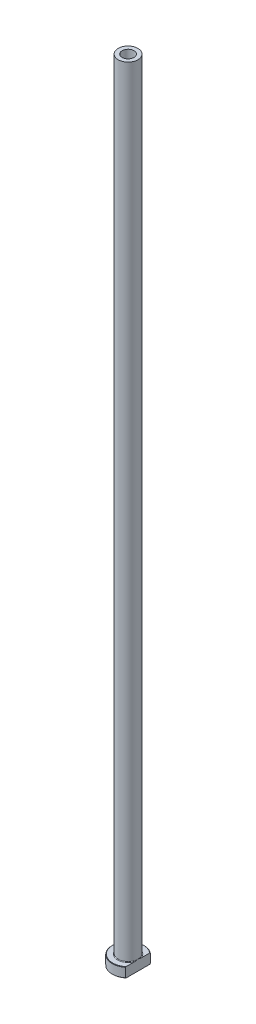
ISO-10303-21;
HEADER;
FILE_DESCRIPTION(('STEP AP214'),'2;1');
FILE_NAME('part.step','',(''),(''),'','','');
FILE_SCHEMA(('AUTOMOTIVE_DESIGN { 1 0 10303 214 1 1 1 1 }'));
ENDSEC;
DATA;
#1=APPLICATION_CONTEXT('core data for automotive mechanical design processes');
#2=APPLICATION_PROTOCOL_DEFINITION('international standard','automotive_design',2000,#1);
#3=PRODUCT_CONTEXT('',#1,'mechanical');
#4=PRODUCT('Part','Part','',(#3));
#5=PRODUCT_RELATED_PRODUCT_CATEGORY('part','',(#4));
#6=PRODUCT_DEFINITION_FORMATION('','',#4);
#7=PRODUCT_DEFINITION_CONTEXT('part definition',#1,'design');
#8=PRODUCT_DEFINITION('design','',#6,#7);
#9=PRODUCT_DEFINITION_SHAPE('','',#8);
#10=(LENGTH_UNIT() NAMED_UNIT(*) SI_UNIT(.MILLI.,.METRE.));
#11=(NAMED_UNIT(*) PLANE_ANGLE_UNIT() SI_UNIT($,.RADIAN.));
#12=(NAMED_UNIT(*) SI_UNIT($,.STERADIAN.) SOLID_ANGLE_UNIT());
#13=UNCERTAINTY_MEASURE_WITH_UNIT(LENGTH_MEASURE(1.E-05),#10,'distance_accuracy_value','');
#14=(GEOMETRIC_REPRESENTATION_CONTEXT(3) GLOBAL_UNCERTAINTY_ASSIGNED_CONTEXT((#13)) GLOBAL_UNIT_ASSIGNED_CONTEXT((#10,
#11,#12)) REPRESENTATION_CONTEXT('',''));
#15=CARTESIAN_POINT('',(0.,0.,0.));
#16=DIRECTION('',(0.,0.,1.));
#17=DIRECTION('',(1.,0.,0.));
#18=AXIS2_PLACEMENT_3D('',#15,#16,#17);
#19=CARTESIAN_POINT('',(0.,92.1876809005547,0.));
#20=DIRECTION('',(0.,1.,0.));
#21=DIRECTION('',(0.,0.,1.));
#22=AXIS2_PLACEMENT_3D('',#19,#20,#21);
#23=CYLINDRICAL_SURFACE('',#22,3.00000000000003);
#24=CARTESIAN_POINT('',(0.,400.,0.));
#25=DIRECTION('',(0.,1.,0.));
#26=DIRECTION('',(0.,0.,1.));
#27=AXIS2_PLACEMENT_3D('',#24,#25,#26);
#28=CIRCLE('',#27,3.00000000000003);
#29=CARTESIAN_POINT('',(0.,400.,3.00000000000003));
#30=VERTEX_POINT('',#29);
#31=EDGE_CURVE('E167',#30,#30,#28,.T.);
#32=ORIENTED_EDGE('',*,*,#31,.T.);
#33=EDGE_LOOP('',(#32));
#34=FACE_BOUND('',#33,.T.);
#35=CARTESIAN_POINT('',(0.,355.,0.));
#36=DIRECTION('',(0.,1.,0.));
#37=DIRECTION('',(0.,0.,1.));
#38=AXIS2_PLACEMENT_3D('',#35,#36,#37);
#39=CIRCLE('',#38,3.00000000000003);
#40=CARTESIAN_POINT('',(0.,355.,3.00000000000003));
#41=VERTEX_POINT('',#40);
#42=EDGE_CURVE('E170',#41,#41,#39,.T.);
#43=ORIENTED_EDGE('',*,*,#42,.F.);
#44=EDGE_LOOP('',(#43));
#45=FACE_BOUND('',#44,.T.);
#46=ADVANCED_FACE('F32',(#34,#45),#23,.F.);
#47=CARTESIAN_POINT('',(-3.00000000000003,400.,0.));
#48=DIRECTION('',(0.,1.,0.));
#49=DIRECTION('',(0.,0.,1.));
#50=AXIS2_PLACEMENT_3D('',#47,#48,#49);
#51=PLANE('',#50);
#52=CARTESIAN_POINT('',(0.,400.,0.));
#53=DIRECTION('',(0.,1.,0.));
#54=DIRECTION('',(0.,0.,1.));
#55=AXIS2_PLACEMENT_3D('',#52,#53,#54);
#56=CIRCLE('',#55,5.00000000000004);
#57=CARTESIAN_POINT('',(0.,400.,5.00000000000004));
#58=VERTEX_POINT('',#57);
#59=EDGE_CURVE('E174',#58,#58,#56,.T.);
#60=ORIENTED_EDGE('',*,*,#59,.T.);
#61=EDGE_LOOP('',(#60));
#62=FACE_BOUND('',#61,.T.);
#63=ORIENTED_EDGE('',*,*,#31,.F.);
#64=EDGE_LOOP('',(#63));
#65=FACE_BOUND('',#64,.T.);
#66=ADVANCED_FACE('F157',(#62,#65),#51,.T.);
#67=CARTESIAN_POINT('',(0.,92.1876809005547,0.));
#68=DIRECTION('',(0.,1.,0.));
#69=DIRECTION('',(0.,0.,1.));
#70=AXIS2_PLACEMENT_3D('',#67,#68,#69);
#71=CYLINDRICAL_SURFACE('',#70,5.00000000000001);
#72=CARTESIAN_POINT('',(0.,5.3,0.));
#73=DIRECTION('',(0.,1.,0.));
#74=DIRECTION('',(0.,0.,1.));
#75=AXIS2_PLACEMENT_3D('',#72,#73,#74);
#76=CIRCLE('',#75,5.00000000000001);
#77=CARTESIAN_POINT('',(5.,5.3,0.));
#78=VERTEX_POINT('',#77);
#79=EDGE_CURVE('E180',#78,#78,#76,.T.);
#80=ORIENTED_EDGE('',*,*,#79,.T.);
#81=EDGE_LOOP('',(#80));
#82=FACE_BOUND('',#81,.T.);
#83=ORIENTED_EDGE('',*,*,#59,.F.);
#84=EDGE_LOOP('',(#83));
#85=FACE_BOUND('',#84,.T.);
#86=ADVANCED_FACE('F162',(#82,#85),#71,.T.);
#87=CARTESIAN_POINT('',(-4.99999999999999,5.,0.));
#88=DIRECTION('',(0.,1.,0.));
#89=DIRECTION('',(0.,0.,1.));
#90=AXIS2_PLACEMENT_3D('',#87,#88,#89);
#91=PLANE('',#90);
#92=DIRECTION('',(0.,0.,1.));
#93=VECTOR('',#92,1.);
#94=CARTESIAN_POINT('',(5.,5.,0.));
#95=LINE('',#94,#93);
#96=CARTESIAN_POINT('',(5.,5.,-5.98665181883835));
#97=VERTEX_POINT('',#96);
#98=CARTESIAN_POINT('',(5.,5.,-1.75783958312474));
#99=VERTEX_POINT('',#98);
#100=EDGE_CURVE('E54',#97,#99,#95,.T.);
#101=ORIENTED_EDGE('',*,*,#100,.F.);
#102=CARTESIAN_POINT('',(0.,5.,0.));
#103=DIRECTION('',(0.,1.,0.));
#104=DIRECTION('',(0.,0.,1.));
#105=AXIS2_PLACEMENT_3D('',#102,#103,#104);
#106=CIRCLE('',#105,7.80000000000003);
#107=CARTESIAN_POINT('',(4.99999999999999,5.,5.98665181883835));
#108=VERTEX_POINT('',#107);
#109=EDGE_CURVE('E186',#97,#108,#106,.T.);
#110=ORIENTED_EDGE('',*,*,#109,.T.);
#111=CARTESIAN_POINT('',(5.,5.,1.75783958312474));
#112=VERTEX_POINT('',#111);
#113=EDGE_CURVE('E134',#112,#108,#95,.T.);
#114=ORIENTED_EDGE('',*,*,#113,.F.);
#115=CARTESIAN_POINT('',(0.,5.,0.));
#116=DIRECTION('',(0.,1.,0.));
#117=DIRECTION('',(0.,0.,1.));
#118=AXIS2_PLACEMENT_3D('',#115,#116,#117);
#119=CIRCLE('',#118,5.30000000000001);
#120=EDGE_CURVE('E183',#112,#99,#119,.F.);
#121=ORIENTED_EDGE('',*,*,#120,.T.);
#122=EDGE_LOOP('',(#101,#110,#114,#121));
#123=FACE_BOUND('',#122,.T.);
#124=ADVANCED_FACE('F197',(#123),#91,.T.);
#125=CARTESIAN_POINT('',(0.,92.1876809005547,0.));
#126=DIRECTION('',(0.,1.,0.));
#127=DIRECTION('',(0.,0.,1.));
#128=AXIS2_PLACEMENT_3D('',#125,#126,#127);
#129=CYLINDRICAL_SURFACE('',#128,7.99999999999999);
#130=DIRECTION('',(0.,-1.,0.));
#131=VECTOR('',#130,1.);
#132=CARTESIAN_POINT('',(4.99999999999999,400.,6.24499799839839));
#133=LINE('',#132,#131);
#134=CARTESIAN_POINT('',(4.99999999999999,4.80000000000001,6.24499799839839));
#135=VERTEX_POINT('',#134);
#136=CARTESIAN_POINT('',(4.99999999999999,0.200000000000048,6.24499799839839));
#137=VERTEX_POINT('',#136);
#138=EDGE_CURVE('E82',#135,#137,#133,.T.);
#139=ORIENTED_EDGE('',*,*,#138,.F.);
#140=CARTESIAN_POINT('',(0.,4.80000000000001,0.));
#141=DIRECTION('',(0.,1.,0.));
#142=DIRECTION('',(0.,0.,1.));
#143=AXIS2_PLACEMENT_3D('',#140,#141,#142);
#144=CIRCLE('',#143,7.99999999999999);
#145=CARTESIAN_POINT('',(5.,4.80000000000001,-6.24499799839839));
#146=VERTEX_POINT('',#145);
#147=EDGE_CURVE('E95',#135,#146,#144,.F.);
#148=ORIENTED_EDGE('',*,*,#147,.T.);
#149=DIRECTION('',(0.,-1.,0.));
#150=VECTOR('',#149,1.);
#151=CARTESIAN_POINT('',(5.,400.,-6.24499799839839));
#152=LINE('',#151,#150);
#153=CARTESIAN_POINT('',(5.,0.200000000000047,-6.24499799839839));
#154=VERTEX_POINT('',#153);
#155=EDGE_CURVE('E192',#146,#154,#152,.T.);
#156=ORIENTED_EDGE('',*,*,#155,.T.);
#157=CARTESIAN_POINT('',(0.,0.200000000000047,0.));
#158=DIRECTION('',(0.,-1.,0.));
#159=DIRECTION('',(0.,0.,-1.));
#160=AXIS2_PLACEMENT_3D('',#157,#158,#159);
#161=CIRCLE('',#160,7.99999999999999);
#162=EDGE_CURVE('E98',#154,#137,#161,.F.);
#163=ORIENTED_EDGE('',*,*,#162,.T.);
#164=EDGE_LOOP('',(#139,#148,#156,#163));
#165=FACE_BOUND('',#164,.T.);
#166=ADVANCED_FACE('F190',(#165),#129,.T.);
#167=CARTESIAN_POINT('',(-7.99999999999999,0.,0.));
#168=DIRECTION('',(0.,-1.,0.));
#169=DIRECTION('',(0.,0.,-1.));
#170=AXIS2_PLACEMENT_3D('',#167,#168,#169);
#171=PLANE('',#170);
#172=CARTESIAN_POINT('',(0.,0.,0.));
#173=DIRECTION('',(0.,-1.,0.));
#174=DIRECTION('',(0.,0.,-1.));
#175=AXIS2_PLACEMENT_3D('',#172,#173,#174);
#176=CIRCLE('',#175,3.75000000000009);
#177=CARTESIAN_POINT('',(0.,0.,-3.75000000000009));
#178=VERTEX_POINT('',#177);
#179=EDGE_CURVE('E40',#178,#178,#176,.F.);
#180=ORIENTED_EDGE('',*,*,#179,.T.);
#181=EDGE_LOOP('',(#180));
#182=FACE_BOUND('',#181,.T.);
#183=DIRECTION('',(0.,0.,-1.));
#184=VECTOR('',#183,1.);
#185=CARTESIAN_POINT('',(4.99999999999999,0.,6.24499799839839));
#186=LINE('',#185,#184);
#187=CARTESIAN_POINT('',(4.99999999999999,0.,5.9866518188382));
#188=VERTEX_POINT('',#187);
#189=CARTESIAN_POINT('',(5.,0.,-5.9866518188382));
#190=VERTEX_POINT('',#189);
#191=EDGE_CURVE('E47',#188,#190,#186,.T.);
#192=ORIENTED_EDGE('',*,*,#191,.F.);
#193=CARTESIAN_POINT('',(0.,0.,0.));
#194=DIRECTION('',(0.,-1.,0.));
#195=DIRECTION('',(0.,0.,-1.));
#196=AXIS2_PLACEMENT_3D('',#193,#194,#195);
#197=CIRCLE('',#196,7.79999999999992);
#198=EDGE_CURVE('E92',#188,#190,#197,.T.);
#199=ORIENTED_EDGE('',*,*,#198,.T.);
#200=EDGE_LOOP('',(#192,#199));
#201=FACE_BOUND('',#200,.T.);
#202=ADVANCED_FACE('F91',(#182,#201),#171,.T.);
#203=CARTESIAN_POINT('',(0.,92.1876809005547,0.));
#204=DIRECTION('',(0.,1.,0.));
#205=DIRECTION('',(0.,0.,1.));
#206=AXIS2_PLACEMENT_3D('',#203,#204,#205);
#207=CYLINDRICAL_SURFACE('',#206,3.25000000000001);
#208=CARTESIAN_POINT('',(0.,0.500000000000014,0.));
#209=DIRECTION('',(0.,-1.,0.));
#210=DIRECTION('',(0.,0.,-1.));
#211=AXIS2_PLACEMENT_3D('',#208,#209,#210);
#212=CIRCLE('',#211,3.25000000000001);
#213=CARTESIAN_POINT('',(0.,0.500000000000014,-3.25000000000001));
#214=VERTEX_POINT('',#213);
#215=EDGE_CURVE('E11',#214,#214,#212,.T.);
#216=ORIENTED_EDGE('',*,*,#215,.T.);
#217=EDGE_LOOP('',(#216));
#218=FACE_BOUND('',#217,.T.);
#219=CARTESIAN_POINT('',(0.,343.,0.));
#220=DIRECTION('',(0.,1.,0.));
#221=DIRECTION('',(0.,0.,1.));
#222=AXIS2_PLACEMENT_3D('',#219,#220,#221);
#223=CIRCLE('',#222,3.25000000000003);
#224=CARTESIAN_POINT('',(0.,343.,3.25000000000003));
#225=VERTEX_POINT('',#224);
#226=EDGE_CURVE('E172',#225,#225,#223,.T.);
#227=ORIENTED_EDGE('',*,*,#226,.T.);
#228=EDGE_LOOP('',(#227));
#229=FACE_BOUND('',#228,.T.);
#230=ADVANCED_FACE('F215',(#218,#229),#207,.F.);
#231=CARTESIAN_POINT('',(0.,343.,0.));
#232=DIRECTION('',(0.,-1.,0.));
#233=DIRECTION('',(0.,0.,-1.));
#234=AXIS2_PLACEMENT_3D('',#231,#232,#233);
#235=CONICAL_SURFACE('',#234,3.25000000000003,0.0208303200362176);
#236=ORIENTED_EDGE('',*,*,#42,.T.);
#237=EDGE_LOOP('',(#236));
#238=FACE_BOUND('',#237,.T.);
#239=ORIENTED_EDGE('',*,*,#226,.F.);
#240=EDGE_LOOP('',(#239));
#241=FACE_BOUND('',#240,.T.);
#242=ADVANCED_FACE('F111',(#238,#241),#235,.F.);
#243=CARTESIAN_POINT('',(0.,5.3,0.));
#244=DIRECTION('',(0.,1.,0.));
#245=DIRECTION('',(0.,0.,1.));
#246=AXIS2_PLACEMENT_3D('',#243,#244,#245);
#247=TOROIDAL_SURFACE('',#246,5.30000000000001,0.3);
#248=ORIENTED_EDGE('',*,*,#120,.F.);
#249=CARTESIAN_POINT('',(5.,5.3,0.));
#250=CARTESIAN_POINT('',(5.,5.30000062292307,-1.31469219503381E-10));
#251=CARTESIAN_POINT('',(5.,5.30000124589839,2.52759529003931E-07));
#252=CARTESIAN_POINT('',(5.,5.30000240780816,9.47164985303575E-07));
#253=CARTESIAN_POINT('',(5.,5.30000293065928,1.40594109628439E-06));
#254=CARTESIAN_POINT('',(5.,5.30000402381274,2.50637707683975E-06));
#255=CARTESIAN_POINT('',(5.,5.30000457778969,3.16589032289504E-06));
#256=CARTESIAN_POINT('',(5.,5.30000556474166,4.5286010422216E-06));
#257=CARTESIAN_POINT('',(5.,5.3000060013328,5.22939577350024E-06));
#258=CARTESIAN_POINT('',(5.,5.30000763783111,7.96122203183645E-06));
#259=CARTESIAN_POINT('',(5.,5.30000875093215,1.00477437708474E-05));
#260=CARTESIAN_POINT('',(5.,5.30001056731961,1.41660905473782E-05));
#261=CARTESIAN_POINT('',(5.,5.30001129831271,1.61861811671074E-05));
#262=CARTESIAN_POINT('',(5.,5.30001439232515,2.47865788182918E-05));
#263=CARTESIAN_POINT('',(5.,5.30001672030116,3.1383034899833E-05));
#264=CARTESIAN_POINT('',(5.,5.30002012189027,4.38084295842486E-05));
#265=CARTESIAN_POINT('',(5.,5.30002133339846,4.95992806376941E-05));
#266=CARTESIAN_POINT('',(5.,5.30003020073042,9.2786271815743E-05));
#267=CARTESIAN_POINT('',(5.,5.30003696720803,0.000130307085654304));
#268=CARTESIAN_POINT('',(4.99999999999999,5.30006659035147,0.000278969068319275));
#269=CARTESIAN_POINT('',(5.,5.30009481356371,0.000389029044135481));
#270=CARTESIAN_POINT('',(5.,5.30020506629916,0.000826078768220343));
#271=CARTESIAN_POINT('',(5.,5.30028365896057,0.00115365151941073));
#272=CARTESIAN_POINT('',(4.99999999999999,5.30059919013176,0.00245925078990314));
#273=CARTESIAN_POINT('',(4.99999999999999,5.30084048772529,0.00343651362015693));
#274=CARTESIAN_POINT('',(5.,5.30184626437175,0.00752058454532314));
#275=CARTESIAN_POINT('',(5.,5.30260525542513,0.0106283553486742));
#276=CARTESIAN_POINT('',(4.99999999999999,5.30996461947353,0.0407482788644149));
#277=CARTESIAN_POINT('',(4.99999999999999,5.31658985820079,0.0677561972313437));
#278=CARTESIAN_POINT('',(5.,5.32953319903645,0.120688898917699));
#279=CARTESIAN_POINT('',(5.,5.33585289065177,0.146613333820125));
#280=CARTESIAN_POINT('',(4.99999999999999,5.34926050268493,0.201795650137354));
#281=CARTESIAN_POINT('',(5.,5.35634306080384,0.231054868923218));
#282=CARTESIAN_POINT('',(5.,5.37050252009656,0.289917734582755));
#283=CARTESIAN_POINT('',(5.,5.37757848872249,0.319521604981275));
#284=CARTESIAN_POINT('',(5.,5.39452602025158,0.391032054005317));
#285=CARTESIAN_POINT('',(5.,5.40434071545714,0.432952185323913));
#286=CARTESIAN_POINT('',(5.,5.42340141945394,0.515763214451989));
#287=CARTESIAN_POINT('',(5.,5.43265559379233,0.556652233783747));
#288=CARTESIAN_POINT('',(5.,5.45710553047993,0.667075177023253));
#289=CARTESIAN_POINT('',(5.,5.47194176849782,0.736689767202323));
#290=CARTESIAN_POINT('',(5.,5.50018229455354,0.876836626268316));
#291=CARTESIAN_POINT('',(5.,5.51357312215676,0.947371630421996));
#292=CARTESIAN_POINT('',(5.,5.53930921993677,1.09497328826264));
#293=CARTESIAN_POINT('',(5.,5.55146217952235,1.17207432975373));
#294=CARTESIAN_POINT('',(5.,5.57239669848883,1.32672649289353));
#295=CARTESIAN_POINT('',(5.,5.58117877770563,1.40427754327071));
#296=CARTESIAN_POINT('',(5.,5.59499725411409,1.56873827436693));
#297=CARTESIAN_POINT('',(5.,5.5994880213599,1.65570044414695));
#298=CARTESIAN_POINT('',(5.,5.60018885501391,1.78535304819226));
#299=CARTESIAN_POINT('',(5.,5.59945214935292,1.82802575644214));
#300=CARTESIAN_POINT('',(5.,5.59559364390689,1.91325081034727));
#301=CARTESIAN_POINT('',(5.,5.5924731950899,1.95580321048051));
#302=CARTESIAN_POINT('',(5.,5.58383242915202,2.03512365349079));
#303=CARTESIAN_POINT('',(5.,5.57867386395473,2.07192937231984));
#304=CARTESIAN_POINT('',(5.,5.5654379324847,2.14526756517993));
#305=CARTESIAN_POINT('',(5.,5.55734203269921,2.18179676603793));
#306=CARTESIAN_POINT('',(5.,5.53718005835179,2.25427226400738));
#307=CARTESIAN_POINT('',(5.,5.52507057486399,2.29020746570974));
#308=CARTESIAN_POINT('',(5.,5.50270928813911,2.34223029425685));
#309=CARTESIAN_POINT('',(5.,5.49457811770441,2.35922314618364));
#310=CARTESIAN_POINT('',(5.,5.476578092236,2.39224900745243));
#311=CARTESIAN_POINT('',(5.,5.46671281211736,2.40828390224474));
#312=CARTESIAN_POINT('',(5.,5.44695893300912,2.43579467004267));
#313=CARTESIAN_POINT('',(5.,5.43745879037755,2.44754592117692));
#314=CARTESIAN_POINT('',(5.,5.41677914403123,2.46946476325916));
#315=CARTESIAN_POINT('',(5.,5.40560543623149,2.47963758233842));
#316=CARTESIAN_POINT('',(5.,5.38617750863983,2.49393642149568));
#317=CARTESIAN_POINT('',(5.,5.37851643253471,2.49886271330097));
#318=CARTESIAN_POINT('',(5.,5.3625274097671,2.5074995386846));
#319=CARTESIAN_POINT('',(5.,5.35419984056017,2.51121075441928));
#320=CARTESIAN_POINT('',(5.,5.33690648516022,2.51712941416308));
#321=CARTESIAN_POINT('',(5.,5.32793451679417,2.519319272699));
#322=CARTESIAN_POINT('',(5.,5.30973576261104,2.52185978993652));
#323=CARTESIAN_POINT('',(5.,5.30050931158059,2.52221275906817));
#324=CARTESIAN_POINT('',(5.,5.28349166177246,2.52112455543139));
#325=CARTESIAN_POINT('',(5.,5.27568322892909,2.51993178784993));
#326=CARTESIAN_POINT('',(5.,5.26036860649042,2.51628294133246));
#327=CARTESIAN_POINT('',(5.,5.25286261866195,2.51382603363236));
#328=CARTESIAN_POINT('',(5.,5.23590266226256,2.50685484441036));
#329=CARTESIAN_POINT('',(5.,5.2266187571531,2.50192984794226));
#330=CARTESIAN_POINT('',(5.,5.20895514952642,2.49066548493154));
#331=CARTESIAN_POINT('',(5.,5.20057756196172,2.4843229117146));
#332=CARTESIAN_POINT('',(5.,5.17987008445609,2.46645212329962));
#333=CARTESIAN_POINT('',(5.,5.16824151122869,2.45411867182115));
#334=CARTESIAN_POINT('',(5.,5.14692461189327,2.42790849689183));
#335=CARTESIAN_POINT('',(5.,5.13723987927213,2.41402898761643));
#336=CARTESIAN_POINT('',(5.,5.11080706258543,2.37143175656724));
#337=CARTESIAN_POINT('',(5.,5.09628770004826,2.34134703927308));
#338=CARTESIAN_POINT('',(5.,5.07130349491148,2.27940731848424));
#339=CARTESIAN_POINT('',(5.,5.06087110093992,2.24754035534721));
#340=CARTESIAN_POINT('',(5.,5.03890359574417,2.16787245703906));
#341=CARTESIAN_POINT('',(5.,5.02913523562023,2.11959065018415));
#342=CARTESIAN_POINT('',(5.,5.01416953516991,2.02224928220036));
#343=CARTESIAN_POINT('',(5.,5.00898637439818,1.97318778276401));
#344=CARTESIAN_POINT('',(5.,5.00220823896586,1.87635767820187));
#345=CARTESIAN_POINT('',(5.,5.00050709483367,1.82859609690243));
#346=CARTESIAN_POINT('',(5.,4.99969104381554,1.7333016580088));
#347=CARTESIAN_POINT('',(5.,5.00056327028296,1.68576884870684));
#348=CARTESIAN_POINT('',(5.,5.00484296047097,1.57937770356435));
#349=CARTESIAN_POINT('',(5.,5.00880932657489,1.52054285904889));
#350=CARTESIAN_POINT('',(5.,5.01925964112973,1.40312974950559));
#351=CARTESIAN_POINT('',(5.,5.02574264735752,1.3445513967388));
#352=CARTESIAN_POINT('',(5.,5.04090087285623,1.22627662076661));
#353=CARTESIAN_POINT('',(5.,5.04962425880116,1.16658647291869));
#354=CARTESIAN_POINT('',(5.,5.06877923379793,1.04732463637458));
#355=CARTESIAN_POINT('',(5.,5.07921523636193,0.987753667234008));
#356=CARTESIAN_POINT('',(5.,5.10551698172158,0.846936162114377));
#357=CARTESIAN_POINT('',(5.,5.12196565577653,0.765799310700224));
#358=CARTESIAN_POINT('',(5.,5.15639716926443,0.604819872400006));
#359=CARTESIAN_POINT('',(5.,5.17436050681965,0.524973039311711));
#360=CARTESIAN_POINT('',(4.99999999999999,5.20921667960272,0.374726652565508));
#361=CARTESIAN_POINT('',(4.99999999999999,5.22599388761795,0.304300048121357));
#362=CARTESIAN_POINT('',(5.,5.25191105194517,0.196907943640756));
#363=CARTESIAN_POINT('',(5.,5.26090146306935,0.159905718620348));
#364=CARTESIAN_POINT('',(4.99999999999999,5.27881854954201,0.0865164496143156));
#365=CARTESIAN_POINT('',(4.99999999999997,5.28774391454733,0.0501291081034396));
#366=CARTESIAN_POINT('',(5.,5.29739627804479,0.0106218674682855));
#367=CARTESIAN_POINT('',(5.,5.2981568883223,0.00750762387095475));
#368=CARTESIAN_POINT('',(4.99999999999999,5.29916304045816,0.00342209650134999));
#369=CARTESIAN_POINT('',(4.99999999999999,5.29940309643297,0.00244985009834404));
#370=CARTESIAN_POINT('',(5.,5.29971711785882,0.00115049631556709));
#371=CARTESIAN_POINT('',(5.,5.29979541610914,0.000824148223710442));
#372=CARTESIAN_POINT('',(4.99999999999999,5.29990531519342,0.000388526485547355));
#373=CARTESIAN_POINT('',(4.99999999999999,5.29993348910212,0.0002786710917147));
#374=CARTESIAN_POINT('',(5.,5.2999630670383,0.000130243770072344));
#375=CARTESIAN_POINT('',(5.,5.29996982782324,9.2751148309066E-05));
#376=CARTESIAN_POINT('',(5.,5.29997868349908,4.95929956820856E-05));
#377=CARTESIAN_POINT('',(5.,5.29997989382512,4.38036630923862E-05));
#378=CARTESIAN_POINT('',(5.,5.29998329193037,3.1381425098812E-05));
#379=CARTESIAN_POINT('',(5.00000000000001,5.29998561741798,2.47865267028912E-05));
#380=CARTESIAN_POINT('',(5.,5.29998870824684,1.61877575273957E-05));
#381=CARTESIAN_POINT('',(5.,5.29998943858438,1.4167780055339E-05));
#382=CARTESIAN_POINT('',(5.,5.29999125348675,1.00495559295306E-05));
#383=CARTESIAN_POINT('',(5.,5.29999236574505,7.96302878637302E-06));
#384=CARTESIAN_POINT('',(5.,5.29999400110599,5.23107548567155E-06));
#385=CARTESIAN_POINT('',(5.,5.29999443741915,4.53021173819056E-06));
#386=CARTESIAN_POINT('',(5.,5.29999542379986,3.1673128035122E-06));
#387=CARTESIAN_POINT('',(5.,5.29999597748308,2.50767829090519E-06));
#388=CARTESIAN_POINT('',(5.,5.29999707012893,1.40695951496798E-06));
#389=CARTESIAN_POINT('',(5.,5.29999759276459,9.48033092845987E-07));
#390=CARTESIAN_POINT('',(5.,5.29999875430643,2.53244638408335E-07));
#391=CARTESIAN_POINT('',(5.,5.29999937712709,1.31460021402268E-10));
#392=CARTESIAN_POINT('',(5.,5.3,0.));
#393=B_SPLINE_CURVE_WITH_KNOTS('',3,(#249,#250,#251,#252,#253,#254,#255,#256,#257,#258,#259,
#260,#261,#262,#263,#264,#265,#266,#267,#268,#269,#270,#271,#272,#273,#274,#275,#276,#277,#278,
#279,#280,#281,#282,#283,#284,#285,#286,#287,#288,#289,#290,#291,#292,#293,#294,#295,#296,#297,
#298,#299,#300,#301,#302,#303,#304,#305,#306,#307,#308,#309,#310,#311,#312,#313,#314,#315,#316,
#317,#318,#319,#320,#321,#322,#323,#324,#325,#326,#327,#328,#329,#330,#331,#332,#333,#334,#335,
#336,#337,#338,#339,#340,#341,#342,#343,#344,#345,#346,#347,#348,#349,#350,#351,#352,#353,#354,
#355,#356,#357,#358,#359,#360,#361,#362,#363,#364,#365,#366,#367,#368,#369,#370,#371,#372,#373,
#374,#375,#376,#377,#378,#379,#380,#381,#382,#383,#384,#385,#386,#387,#388,#389,#390,#391,#392),
.UNSPECIFIED.,.T.,.F.,(4,2,2,2,2,2,2,2,2,2,2,2,2,2,2,2,2,2,2,2,2,2,2,2,2,2,2,2,2,2,2,2,2,2,2,2,
2,2,2,2,2,2,2,2,2,2,2,2,2,2,2,2,2,2,2,2,2,2,2,2,2,2,2,2,2,2,2,2,2,2,2,4),(0.,
1.88938937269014E-06,3.9805824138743E-06,6.54817710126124E-06,9.02403309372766E-06,
1.60938629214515E-05,2.25328043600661E-05,4.34843776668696E-05,6.12120009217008E-05,
0.000175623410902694,0.000516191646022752,0.00152710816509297,0.00454656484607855,
0.0141443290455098,0.0975679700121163,0.17761933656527,0.267931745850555,0.359245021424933,
0.48840519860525,0.614173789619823,0.82769427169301,1.04305715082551,1.27715608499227,
1.5112189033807,1.77214751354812,1.90013509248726,2.02805018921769,2.13945459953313,
2.25157451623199,2.36494894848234,2.42139235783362,2.47772074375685,2.52293802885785,
2.56800219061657,2.59524342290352,2.62246933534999,2.65000494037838,2.67750590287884,
2.70108948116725,2.72468854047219,2.75603978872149,2.7874626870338,2.83802806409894,
2.88868607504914,2.98834295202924,3.08877575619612,3.2361865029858,3.38405153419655,
3.52733651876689,3.6699063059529,3.84673903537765,4.0235056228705,4.20444776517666,
4.38586374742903,4.63419556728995,4.87971270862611,5.09690175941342,5.21113882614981,
5.32353360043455,5.3331513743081,5.33615533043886,5.33716246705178,5.33750240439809,
5.33761672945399,5.33763445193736,5.33765539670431,5.33766183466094,5.33766890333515,
5.33767137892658,5.33767394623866,5.33767603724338,5.3376779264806),.UNSPECIFIED.);
#394=EDGE_CURVE('E126',#112,#78,#393,.T.);
#395=ORIENTED_EDGE('',*,*,#394,.T.);
#396=ORIENTED_EDGE('',*,*,#79,.F.);
#397=CARTESIAN_POINT('',(5.,5.3,0.));
#398=CARTESIAN_POINT('',(5.,5.29999937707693,1.31470732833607E-10));
#399=CARTESIAN_POINT('',(5.,5.2999987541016,-2.52759527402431E-07));
#400=CARTESIAN_POINT('',(5.,5.29999759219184,-9.47164983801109E-07));
#401=CARTESIAN_POINT('',(5.,5.29999706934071,-1.40594109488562E-06));
#402=CARTESIAN_POINT('',(5.,5.29999597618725,-2.50637707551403E-06));
#403=CARTESIAN_POINT('',(5.,5.29999542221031,-3.16589032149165E-06));
#404=CARTESIAN_POINT('',(5.,5.29999443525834,-4.52860104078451E-06));
#405=CARTESIAN_POINT('',(5.,5.2999939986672,-5.22939577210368E-06));
#406=CARTESIAN_POINT('',(5.,5.29999236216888,-7.96122203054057E-06));
#407=CARTESIAN_POINT('',(5.,5.29999124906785,-1.00477437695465E-05));
#408=CARTESIAN_POINT('',(5.,5.29998943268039,-1.41660905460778E-05));
#409=CARTESIAN_POINT('',(5.,5.29998870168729,-1.61861811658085E-05));
#410=CARTESIAN_POINT('',(5.,5.29998560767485,-2.47865788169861E-05));
#411=CARTESIAN_POINT('',(5.,5.29998327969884,-3.13830348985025E-05));
#412=CARTESIAN_POINT('',(5.,5.29997987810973,-4.38084295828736E-05));
#413=CARTESIAN_POINT('',(5.,5.29997866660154,-4.95992806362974E-05));
#414=CARTESIAN_POINT('',(5.,5.29996979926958,-9.27862718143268E-05));
#415=CARTESIAN_POINT('',(5.,5.29996303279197,-0.000130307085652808));
#416=CARTESIAN_POINT('',(4.99999999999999,5.29993340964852,-0.000278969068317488));
#417=CARTESIAN_POINT('',(5.,5.29990518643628,-0.000389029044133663));
#418=CARTESIAN_POINT('',(5.,5.29979493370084,-0.000826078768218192));
#419=CARTESIAN_POINT('',(5.,5.29971634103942,-0.00115365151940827));
#420=CARTESIAN_POINT('',(4.99999999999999,5.29940080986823,-0.00245925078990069));
#421=CARTESIAN_POINT('',(4.99999999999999,5.29915951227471,-0.00343651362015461));
#422=CARTESIAN_POINT('',(5.,5.29815373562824,-0.00752058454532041));
#423=CARTESIAN_POINT('',(5.,5.29739474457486,-0.0106283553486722));
#424=CARTESIAN_POINT('',(4.99999999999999,5.29003538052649,-0.0407482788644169));
#425=CARTESIAN_POINT('',(4.99999999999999,5.28341014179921,-0.0677561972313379));
#426=CARTESIAN_POINT('',(5.,5.27046680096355,-0.120688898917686));
#427=CARTESIAN_POINT('',(5.,5.26414710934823,-0.146613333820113));
#428=CARTESIAN_POINT('',(4.99999999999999,5.25073949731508,-0.201795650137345));
#429=CARTESIAN_POINT('',(5.,5.24365693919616,-0.231054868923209));
#430=CARTESIAN_POINT('',(5.,5.22949747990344,-0.289917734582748));
#431=CARTESIAN_POINT('',(5.,5.22242151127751,-0.319521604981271));
#432=CARTESIAN_POINT('',(5.,5.20547397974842,-0.391032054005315));
#433=CARTESIAN_POINT('',(5.,5.19565928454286,-0.432952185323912));
#434=CARTESIAN_POINT('',(5.,5.17659858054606,-0.515763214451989));
#435=CARTESIAN_POINT('',(5.,5.16734440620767,-0.556652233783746));
#436=CARTESIAN_POINT('',(5.,5.14289446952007,-0.667075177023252));
#437=CARTESIAN_POINT('',(5.,5.12805823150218,-0.736689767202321));
#438=CARTESIAN_POINT('',(5.,5.09981770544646,-0.876836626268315));
#439=CARTESIAN_POINT('',(5.,5.08642687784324,-0.947371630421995));
#440=CARTESIAN_POINT('',(5.,5.06069078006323,-1.09497328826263));
#441=CARTESIAN_POINT('',(5.,5.04853782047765,-1.17207432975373));
#442=CARTESIAN_POINT('',(5.,5.02760330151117,-1.32672649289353));
#443=CARTESIAN_POINT('',(5.,5.01882122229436,-1.40427754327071));
#444=CARTESIAN_POINT('',(5.,5.00500274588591,-1.56873827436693));
#445=CARTESIAN_POINT('',(5.,5.00051197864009,-1.65570044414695));
#446=CARTESIAN_POINT('',(5.,4.99981114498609,-1.78535304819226));
#447=CARTESIAN_POINT('',(5.,5.00054785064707,-1.82802575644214));
#448=CARTESIAN_POINT('',(5.,5.0044063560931,-1.91325081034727));
#449=CARTESIAN_POINT('',(5.,5.0075268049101,-1.95580321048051));
#450=CARTESIAN_POINT('',(5.,5.01616757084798,-2.03512365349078));
#451=CARTESIAN_POINT('',(5.,5.02132613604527,-2.07192937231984));
#452=CARTESIAN_POINT('',(5.,5.0345620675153,-2.14526756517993));
#453=CARTESIAN_POINT('',(5.,5.04265796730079,-2.18179676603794));
#454=CARTESIAN_POINT('',(5.,5.06281994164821,-2.25427226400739));
#455=CARTESIAN_POINT('',(5.,5.07492942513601,-2.29020746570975));
#456=CARTESIAN_POINT('',(5.,5.09729071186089,-2.34223029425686));
#457=CARTESIAN_POINT('',(5.,5.1054218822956,-2.35922314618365));
#458=CARTESIAN_POINT('',(5.,5.123421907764,-2.39224900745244));
#459=CARTESIAN_POINT('',(5.,5.13328718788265,-2.40828390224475));
#460=CARTESIAN_POINT('',(5.,5.15304106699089,-2.43579467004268));
#461=CARTESIAN_POINT('',(5.,5.16254120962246,-2.44754592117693));
#462=CARTESIAN_POINT('',(5.,5.18322085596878,-2.46946476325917));
#463=CARTESIAN_POINT('',(5.,5.19439456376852,-2.47963758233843));
#464=CARTESIAN_POINT('',(5.,5.21382249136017,-2.49393642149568));
#465=CARTESIAN_POINT('',(5.,5.22148356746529,-2.49886271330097));
#466=CARTESIAN_POINT('',(5.,5.2374725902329,-2.5074995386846));
#467=CARTESIAN_POINT('',(5.,5.24580015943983,-2.51121075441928));
#468=CARTESIAN_POINT('',(5.,5.26309351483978,-2.51712941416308));
#469=CARTESIAN_POINT('',(5.,5.27206548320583,-2.519319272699));
#470=CARTESIAN_POINT('',(5.,5.29026423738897,-2.52185978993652));
#471=CARTESIAN_POINT('',(5.,5.29949068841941,-2.52221275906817));
#472=CARTESIAN_POINT('',(5.,5.31650833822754,-2.52112455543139));
#473=CARTESIAN_POINT('',(5.,5.32431677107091,-2.51993178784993));
#474=CARTESIAN_POINT('',(5.,5.33963139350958,-2.51628294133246));
#475=CARTESIAN_POINT('',(5.,5.34713738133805,-2.51382603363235));
#476=CARTESIAN_POINT('',(5.,5.36409733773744,-2.50685484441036));
#477=CARTESIAN_POINT('',(5.,5.3733812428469,-2.50192984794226));
#478=CARTESIAN_POINT('',(5.,5.39104485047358,-2.49066548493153));
#479=CARTESIAN_POINT('',(5.,5.39942243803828,-2.4843229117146));
#480=CARTESIAN_POINT('',(5.,5.42012991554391,-2.46645212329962));
#481=CARTESIAN_POINT('',(5.,5.43175848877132,-2.45411867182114));
#482=CARTESIAN_POINT('',(5.,5.45307538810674,-2.42790849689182));
#483=CARTESIAN_POINT('',(5.,5.46276012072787,-2.41402898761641));
#484=CARTESIAN_POINT('',(5.,5.48919293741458,-2.37143175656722));
#485=CARTESIAN_POINT('',(5.,5.50371229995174,-2.34134703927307));
#486=CARTESIAN_POINT('',(5.,5.52869650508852,-2.27940731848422));
#487=CARTESIAN_POINT('',(5.,5.53912889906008,-2.24754035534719));
#488=CARTESIAN_POINT('',(5.,5.56109640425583,-2.16787245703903));
#489=CARTESIAN_POINT('',(5.,5.57086476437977,-2.11959065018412));
#490=CARTESIAN_POINT('',(5.,5.58583046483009,-2.02224928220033));
#491=CARTESIAN_POINT('',(5.,5.59101362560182,-1.97318778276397));
#492=CARTESIAN_POINT('',(5.,5.59779176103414,-1.87635767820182));
#493=CARTESIAN_POINT('',(5.,5.59949290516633,-1.82859609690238));
#494=CARTESIAN_POINT('',(5.,5.60030895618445,-1.73330165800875));
#495=CARTESIAN_POINT('',(5.,5.59943672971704,-1.68576884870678));
#496=CARTESIAN_POINT('',(5.,5.59515703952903,-1.5793777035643));
#497=CARTESIAN_POINT('',(5.,5.59119067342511,-1.52054285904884));
#498=CARTESIAN_POINT('',(5.,5.58074035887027,-1.40312974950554));
#499=CARTESIAN_POINT('',(5.,5.57425735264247,-1.34455139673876));
#500=CARTESIAN_POINT('',(5.,5.55909912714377,-1.22627662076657));
#501=CARTESIAN_POINT('',(5.,5.55037574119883,-1.16658647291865));
#502=CARTESIAN_POINT('',(5.,5.53122076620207,-1.04732463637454));
#503=CARTESIAN_POINT('',(5.,5.52078476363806,-0.987753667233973));
#504=CARTESIAN_POINT('',(5.,5.49448301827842,-0.846936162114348));
#505=CARTESIAN_POINT('',(5.,5.47803434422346,-0.765799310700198));
#506=CARTESIAN_POINT('',(5.,5.44360283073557,-0.604819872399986));
#507=CARTESIAN_POINT('',(5.,5.42563949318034,-0.524973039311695));
#508=CARTESIAN_POINT('',(4.99999999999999,5.39078332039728,-0.374726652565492));
#509=CARTESIAN_POINT('',(4.99999999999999,5.37400611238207,-0.304300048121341));
#510=CARTESIAN_POINT('',(5.,5.34808894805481,-0.196907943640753));
#511=CARTESIAN_POINT('',(5.,5.3390985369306,-0.159905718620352));
#512=CARTESIAN_POINT('',(4.99999999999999,5.32118145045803,-0.0865164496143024));
#513=CARTESIAN_POINT('',(4.99999999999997,5.31225608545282,-0.0501291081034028));
#514=CARTESIAN_POINT('',(5.,5.30260372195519,-0.0106218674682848));
#515=CARTESIAN_POINT('',(5.,5.30184311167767,-0.00750762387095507));
#516=CARTESIAN_POINT('',(4.99999999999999,5.30083695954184,-0.00342209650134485));
#517=CARTESIAN_POINT('',(4.99999999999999,5.30059690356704,-0.00244985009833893));
#518=CARTESIAN_POINT('',(5.,5.30028288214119,-0.00115049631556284));
#519=CARTESIAN_POINT('',(5.,5.30020458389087,-0.000824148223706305));
#520=CARTESIAN_POINT('',(4.99999999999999,5.30009468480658,-0.000388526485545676));
#521=CARTESIAN_POINT('',(4.99999999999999,5.30006651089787,-0.00027867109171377));
#522=CARTESIAN_POINT('',(5.,5.30003693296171,-0.000130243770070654));
#523=CARTESIAN_POINT('',(5.,5.30003017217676,-9.27511483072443E-05));
#524=CARTESIAN_POINT('',(5.,5.30002131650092,-4.95929956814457E-05));
#525=CARTESIAN_POINT('',(5.,5.30002010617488,-4.38036630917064E-05));
#526=CARTESIAN_POINT('',(5.,5.30001670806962,-3.13814250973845E-05));
#527=CARTESIAN_POINT('',(5.00000000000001,5.30001438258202,-2.47865267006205E-05));
#528=CARTESIAN_POINT('',(5.,5.30001129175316,-1.61877575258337E-05));
#529=CARTESIAN_POINT('',(5.,5.30001056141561,-1.41677800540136E-05));
#530=CARTESIAN_POINT('',(5.,5.30000874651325,-1.00495559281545E-05));
#531=CARTESIAN_POINT('',(5.,5.30000763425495,-7.96302878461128E-06));
#532=CARTESIAN_POINT('',(5.,5.30000599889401,-5.2310754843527E-06));
#533=CARTESIAN_POINT('',(5.,5.30000556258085,-4.53021173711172E-06));
#534=CARTESIAN_POINT('',(5.,5.30000457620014,-3.16731280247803E-06));
#535=CARTESIAN_POINT('',(5.,5.30000402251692,-2.50767828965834E-06));
#536=CARTESIAN_POINT('',(5.,5.30000292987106,-1.40695951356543E-06));
#537=CARTESIAN_POINT('',(5.,5.30000240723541,-9.48033091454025E-07));
#538=CARTESIAN_POINT('',(5.,5.30000124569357,-2.53244637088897E-07));
#539=CARTESIAN_POINT('',(5.,5.30000062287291,-1.31458756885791E-10));
#540=CARTESIAN_POINT('',(5.,5.3,0.));
#541=B_SPLINE_CURVE_WITH_KNOTS('',3,(#397,#398,#399,#400,#401,#402,#403,#404,#405,#406,#407,
#408,#409,#410,#411,#412,#413,#414,#415,#416,#417,#418,#419,#420,#421,#422,#423,#424,#425,#426,
#427,#428,#429,#430,#431,#432,#433,#434,#435,#436,#437,#438,#439,#440,#441,#442,#443,#444,#445,
#446,#447,#448,#449,#450,#451,#452,#453,#454,#455,#456,#457,#458,#459,#460,#461,#462,#463,#464,
#465,#466,#467,#468,#469,#470,#471,#472,#473,#474,#475,#476,#477,#478,#479,#480,#481,#482,#483,
#484,#485,#486,#487,#488,#489,#490,#491,#492,#493,#494,#495,#496,#497,#498,#499,#500,#501,#502,
#503,#504,#505,#506,#507,#508,#509,#510,#511,#512,#513,#514,#515,#516,#517,#518,#519,#520,#521,
#522,#523,#524,#525,#526,#527,#528,#529,#530,#531,#532,#533,#534,#535,#536,#537,#538,#539,#540),
.UNSPECIFIED.,.T.,.F.,(4,2,2,2,2,2,2,2,2,2,2,2,2,2,2,2,2,2,2,2,2,2,2,2,2,2,2,2,2,2,2,2,2,2,2,2,
2,2,2,2,2,2,2,2,2,2,2,2,2,2,2,2,2,2,2,2,2,2,2,2,2,2,2,2,2,2,2,2,2,2,2,4),(0.,
1.88938937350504E-06,3.98058241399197E-06,6.54817710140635E-06,9.02403309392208E-06,
1.60938629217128E-05,2.25328043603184E-05,4.34843776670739E-05,6.12120009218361E-05,
0.000175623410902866,0.000516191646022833,0.00152710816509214,0.00454656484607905,
0.0141443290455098,0.0975679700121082,0.177619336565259,0.267931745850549,0.359245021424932,
0.488405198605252,0.614173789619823,0.82769427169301,1.04305715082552,1.27715608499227,
1.5112189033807,1.77214751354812,1.90013509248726,2.02805018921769,2.13945459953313,
2.251574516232,2.36494894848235,2.42139235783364,2.47772074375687,2.52293802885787,
2.56800219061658,2.59524342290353,2.62246933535,2.65000494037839,2.67750590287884,
2.70108948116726,2.7246885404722,2.75603978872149,2.78746268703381,2.83802806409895,
2.88868607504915,2.98834295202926,3.08877575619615,3.23618650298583,3.38405153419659,
3.52733651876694,3.66990630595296,3.8467390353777,4.02350562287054,4.20444776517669,
4.38586374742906,4.63419556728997,4.87971270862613,5.09690175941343,5.21113882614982,
5.32353360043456,5.33315137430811,5.33615533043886,5.33716246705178,5.33750240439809,
5.33761672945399,5.33763445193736,5.33765539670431,5.33766183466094,5.33766890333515,
5.33767137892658,5.33767394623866,5.33767603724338,5.3376779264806),.UNSPECIFIED.);
#542=EDGE_CURVE('E135',#78,#99,#541,.T.);
#543=ORIENTED_EDGE('',*,*,#542,.T.);
#544=EDGE_LOOP('',(#248,#395,#396,#543));
#545=FACE_BOUND('',#544,.T.);
#546=ADVANCED_FACE('F141',(#545),#247,.F.);
#547=CARTESIAN_POINT('',(0.,5.,0.));
#548=DIRECTION('',(0.,-1.,0.));
#549=DIRECTION('',(0.,0.,-1.));
#550=AXIS2_PLACEMENT_3D('',#547,#548,#549);
#551=CONICAL_SURFACE('',#550,7.80000000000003,0.78539816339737);
#552=CARTESIAN_POINT('',(5.,-1.82162423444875,-13.7401563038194));
#553=CARTESIAN_POINT('',(5.,-1.61889813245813,-13.5244204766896));
#554=CARTESIAN_POINT('',(5.,-1.41646387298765,-13.3084101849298));
#555=CARTESIAN_POINT('',(5.,-1.01227657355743,-12.8757508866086));
#556=CARTESIAN_POINT('',(5.,-0.81052353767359,-12.6591018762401));
#557=CARTESIAN_POINT('',(5.,-0.206157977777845,-12.0077661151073));
#558=CARTESIAN_POINT('',(5.,0.195280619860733,-11.5719884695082));
#559=CARTESIAN_POINT('',(5.,1.00388282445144,-10.6856136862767));
#560=CARTESIAN_POINT('',(5.,1.41093902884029,-10.2349182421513));
#561=CARTESIAN_POINT('',(5.,2.01658324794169,-9.5547167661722));
#562=CARTESIAN_POINT('',(5.,2.21758236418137,-9.32735800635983));
#563=CARTESIAN_POINT('',(5.,2.61761142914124,-8.87091599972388));
#564=CARTESIAN_POINT('',(5.,2.8166413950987,-8.64183276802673));
#565=CARTESIAN_POINT('',(5.,3.21217345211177,-8.18170099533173));
#566=CARTESIAN_POINT('',(5.,3.40867681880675,-7.95065355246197));
#567=CARTESIAN_POINT('',(5.,3.79865427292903,-7.48599989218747));
#568=CARTESIAN_POINT('',(5.,3.99212827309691,-7.25239360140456));
#569=CARTESIAN_POINT('',(5.,4.37558160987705,-6.78155890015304));
#570=CARTESIAN_POINT('',(5.,4.56555334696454,-6.54432428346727));
#571=CARTESIAN_POINT('',(5.,4.94042138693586,-6.0658957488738));
#572=CARTESIAN_POINT('',(5.,5.12531810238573,-5.82470215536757));
#573=CARTESIAN_POINT('',(5.,5.48653546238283,-5.33972956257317));
#574=CARTESIAN_POINT('',(5.,5.66292392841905,-5.09600137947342));
#575=CARTESIAN_POINT('',(5.,6.00675382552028,-4.60213647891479));
#576=CARTESIAN_POINT('',(5.,6.17419169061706,-4.35199726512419));
#577=CARTESIAN_POINT('',(5.,6.49592993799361,-3.84445040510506));
#578=CARTESIAN_POINT('',(5.,6.65027272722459,-3.58707012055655));
#579=CARTESIAN_POINT('',(5.,6.86813414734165,-3.19356592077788));
#580=CARTESIAN_POINT('',(5.,6.93845533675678,-3.06120993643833));
#581=CARTESIAN_POINT('',(5.,7.07360441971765,-2.79373319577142));
#582=CARTESIAN_POINT('',(5.,7.13843319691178,-2.65861288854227));
#583=CARTESIAN_POINT('',(5.,7.26869642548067,-2.36936389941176));
#584=CARTESIAN_POINT('',(5.,7.33331212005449,-2.21486278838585));
#585=CARTESIAN_POINT('',(5.,7.45243473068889,-1.90194073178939));
#586=CARTESIAN_POINT('',(5.,7.50694001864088,-1.74351915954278));
#587=CARTESIAN_POINT('',(5.,7.60343746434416,-1.42384276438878));
#588=CARTESIAN_POINT('',(5.,7.645499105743,-1.26260921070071));
#589=CARTESIAN_POINT('',(5.,7.71543089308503,-0.9370622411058));
#590=CARTESIAN_POINT('',(5.,7.74330266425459,-0.772749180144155));
#591=CARTESIAN_POINT('',(5.,7.78344284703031,-0.439876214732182));
#592=CARTESIAN_POINT('',(5.,7.79548961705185,-0.271289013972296));
#593=CARTESIAN_POINT('',(5.,7.8024080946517,0.0662275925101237));
#594=CARTESIAN_POINT('',(5.,7.79728142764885,0.235156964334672));
#595=CARTESIAN_POINT('',(5.,7.77017954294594,0.572209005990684));
#596=CARTESIAN_POINT('',(5.,7.7481473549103,0.740327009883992));
#597=CARTESIAN_POINT('',(5.,7.68863212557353,1.07379849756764));
#598=CARTESIAN_POINT('',(5.,7.6511443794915,1.23915112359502));
#599=CARTESIAN_POINT('',(5.,7.5473443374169,1.62344926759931));
#600=CARTESIAN_POINT('',(5.,7.47553580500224,1.84089917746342));
#601=CARTESIAN_POINT('',(5.,7.31300119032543,2.26856946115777));
#602=CARTESIAN_POINT('',(5.,7.2222646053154,2.4787857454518));
#603=CARTESIAN_POINT('',(5.,7.07492970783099,2.79014067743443));
#604=CARTESIAN_POINT('',(5.,7.02362278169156,2.89384077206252));
#605=CARTESIAN_POINT('',(5.,6.9178384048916,3.09961626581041));
#606=CARTESIAN_POINT('',(4.99999999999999,6.86336091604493,3.20169164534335));
#607=CARTESIAN_POINT('',(4.99999999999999,6.75169048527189,3.40428995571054));
#608=CARTESIAN_POINT('',(4.99999999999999,6.69449856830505,3.50481345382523));
#609=CARTESIAN_POINT('',(4.99999999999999,6.57774196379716,3.70446206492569));
#610=CARTESIAN_POINT('',(4.99999999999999,6.51817739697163,3.80358724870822));
#611=CARTESIAN_POINT('',(4.99999999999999,6.3085365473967,4.14435766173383));
#612=CARTESIAN_POINT('',(4.99999999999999,6.15326588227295,4.38281352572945));
#613=CARTESIAN_POINT('',(4.99999999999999,5.83377190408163,4.85367607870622));
#614=CARTESIAN_POINT('',(4.99999999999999,5.66954595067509,5.08608095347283));
#615=CARTESIAN_POINT('',(4.99999999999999,5.3343169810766,5.54628554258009));
#616=CARTESIAN_POINT('',(4.99999999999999,5.16330740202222,5.77408045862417));
#617=CARTESIAN_POINT('',(4.99999999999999,4.81629923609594,6.22578157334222));
#618=CARTESIAN_POINT('',(4.99999999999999,4.64030119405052,6.44968819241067));
#619=CARTESIAN_POINT('',(4.99999999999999,4.28368615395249,6.89532578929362));
#620=CARTESIAN_POINT('',(4.99999999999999,4.10305289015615,7.11704371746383));
#621=CARTESIAN_POINT('',(4.99999999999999,3.73870710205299,7.55793799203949));
#622=CARTESIAN_POINT('',(4.99999999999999,3.55499450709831,7.77711427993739));
#623=CARTESIAN_POINT('',(4.99999999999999,3.18521083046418,8.21325328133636));
#624=CARTESIAN_POINT('',(4.99999999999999,2.9991411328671,8.43021717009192));
#625=CARTESIAN_POINT('',(4.99999999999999,2.62499812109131,8.86241167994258));
#626=CARTESIAN_POINT('',(4.99999999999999,2.43692478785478,9.0776422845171));
#627=CARTESIAN_POINT('',(4.99999999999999,1.91463404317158,9.67075518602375));
#628=CARTESIAN_POINT('',(4.99999999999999,1.57868086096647,10.047108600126));
#629=CARTESIAN_POINT('',(4.99999999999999,0.903003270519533,10.796512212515));
#630=CARTESIAN_POINT('',(4.99999999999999,0.563278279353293,11.1695618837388));
#631=CARTESIAN_POINT('',(4.99999999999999,-0.116149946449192,11.9100168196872));
#632=CARTESIAN_POINT('',(4.99999999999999,-0.455830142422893,12.2774432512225));
#633=CARTESIAN_POINT('',(4.99999999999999,-1.13728640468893,13.0102135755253));
#634=CARTESIAN_POINT('',(4.99999999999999,-1.47906204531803,13.3755578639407));
#635=CARTESIAN_POINT('',(4.99999999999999,-1.82162423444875,13.7401563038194));
#636=B_SPLINE_CURVE_WITH_KNOTS('',3,(#552,#553,#554,#555,#556,#557,#558,#559,#560,#561,#562,
#563,#564,#565,#566,#567,#568,#569,#570,#571,#572,#573,#574,#575,#576,#577,#578,#579,#580,#581,
#582,#583,#584,#585,#586,#587,#588,#589,#590,#591,#592,#593,#594,#595,#596,#597,#598,#599,#600,
#601,#602,#603,#604,#605,#606,#607,#608,#609,#610,#611,#612,#613,#614,#615,#616,#617,#618,#619,
#620,#621,#622,#623,#624,#625,#626,#627,#628,#629,#630,#631,#632,#633,#634,#635),.UNSPECIFIED.,
.F.,.F.,(4,2,2,2,2,2,2,2,2,2,2,2,2,2,2,2,2,2,2,2,2,2,2,2,2,2,2,2,2,2,2,2,2,2,2,2,2,2,2,2,2,4),
(0.,0.888120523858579,1.77624635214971,3.55372511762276,5.37559481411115,6.28598924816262,
7.19637570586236,8.10628289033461,9.01621623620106,9.92793449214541,10.8395784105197,
11.7420025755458,12.6447836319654,13.5445196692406,13.9940505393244,14.4435089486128,
14.9456212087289,15.4478142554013,15.9471477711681,16.4464240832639,16.952621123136,
17.458770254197,17.9666326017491,18.4746496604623,19.1604516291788,19.8466351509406,
20.1936870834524,20.5407431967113,20.8876692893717,21.234577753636,22.0879097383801,
22.9414946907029,23.7959266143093,24.6502655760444,25.5081848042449,26.3661237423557,
27.2235803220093,28.0810450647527,29.5944656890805,31.1081235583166,32.6092678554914,
34.1101167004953),.UNSPECIFIED.);
#637=EDGE_CURVE('E133',#146,#97,#636,.T.);
#638=ORIENTED_EDGE('',*,*,#637,.F.);
#639=ORIENTED_EDGE('',*,*,#147,.F.);
#640=EDGE_CURVE('E118',#108,#135,#636,.T.);
#641=ORIENTED_EDGE('',*,*,#640,.F.);
#642=ORIENTED_EDGE('',*,*,#109,.F.);
#643=EDGE_LOOP('',(#638,#639,#641,#642));
#644=FACE_BOUND('',#643,.T.);
#645=ADVANCED_FACE('F145',(#644),#551,.T.);
#646=CARTESIAN_POINT('',(0.,0.200000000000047,0.));
#647=DIRECTION('',(0.,1.,0.));
#648=DIRECTION('',(0.,0.,1.));
#649=AXIS2_PLACEMENT_3D('',#646,#647,#648);
#650=CONICAL_SURFACE('',#649,7.99999999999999,0.785398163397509);
#651=CARTESIAN_POINT('',(4.99999999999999,6.82162423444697,13.7401563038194));
#652=CARTESIAN_POINT('',(4.99999999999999,6.61889813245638,13.5244204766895));
#653=CARTESIAN_POINT('',(4.99999999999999,6.41646387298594,13.3084101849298));
#654=CARTESIAN_POINT('',(4.99999999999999,6.01227657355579,12.8757508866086));
#655=CARTESIAN_POINT('',(4.99999999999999,5.81052353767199,12.65910187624));
#656=CARTESIAN_POINT('',(4.99999999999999,5.20615797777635,12.0077661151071));
#657=CARTESIAN_POINT('',(4.99999999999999,4.80471938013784,11.571988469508));
#658=CARTESIAN_POINT('',(4.99999999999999,3.99611717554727,10.6856136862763));
#659=CARTESIAN_POINT('',(4.99999999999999,3.58906097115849,10.234918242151));
#660=CARTESIAN_POINT('',(4.99999999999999,2.98341675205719,9.55471676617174));
#661=CARTESIAN_POINT('',(4.99999999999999,2.78241763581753,9.32735800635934));
#662=CARTESIAN_POINT('',(4.99999999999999,2.38238857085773,8.87091599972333));
#663=CARTESIAN_POINT('',(4.99999999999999,2.18335860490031,8.64183276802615));
#664=CARTESIAN_POINT('',(4.99999999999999,1.7878265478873,8.18170099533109));
#665=CARTESIAN_POINT('',(4.99999999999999,1.59132318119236,7.95065355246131));
#666=CARTESIAN_POINT('',(4.99999999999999,1.20134572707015,7.48599989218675));
#667=CARTESIAN_POINT('',(4.99999999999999,1.00787172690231,7.25239360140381));
#668=CARTESIAN_POINT('',(4.99999999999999,0.624418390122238,6.78155890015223));
#669=CARTESIAN_POINT('',(4.99999999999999,0.434446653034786,6.54432428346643));
#670=CARTESIAN_POINT('',(4.99999999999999,0.0595786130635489,6.0658957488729));
#671=CARTESIAN_POINT('',(4.99999999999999,-0.125318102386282,5.82470215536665));
#672=CARTESIAN_POINT('',(4.99999999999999,-0.486535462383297,5.33972956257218));
#673=CARTESIAN_POINT('',(4.99999999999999,-0.662923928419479,5.09600137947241));
#674=CARTESIAN_POINT('',(4.99999999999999,-1.00675382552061,4.60213647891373));
#675=CARTESIAN_POINT('',(4.99999999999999,-1.17419169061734,4.3519972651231));
#676=CARTESIAN_POINT('',(4.99999999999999,-1.49592993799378,3.84445040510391));
#677=CARTESIAN_POINT('',(4.99999999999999,-1.65027272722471,3.58707012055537));
#678=CARTESIAN_POINT('',(4.99999999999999,-1.86813414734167,3.19356592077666));
#679=CARTESIAN_POINT('',(5.,-1.93845533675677,3.0612099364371));
#680=CARTESIAN_POINT('',(5.,-2.07360441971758,2.79373319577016));
#681=CARTESIAN_POINT('',(5.,-2.13843319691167,2.65861288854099));
#682=CARTESIAN_POINT('',(5.,-2.26869642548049,2.36936389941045));
#683=CARTESIAN_POINT('',(5.,-2.33331212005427,2.21486278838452));
#684=CARTESIAN_POINT('',(5.,-2.45243473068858,1.90194073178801));
#685=CARTESIAN_POINT('',(5.,-2.50694001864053,1.74351915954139));
#686=CARTESIAN_POINT('',(5.,-2.60343746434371,1.42384276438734));
#687=CARTESIAN_POINT('',(5.,-2.64549910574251,1.26260921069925));
#688=CARTESIAN_POINT('',(5.,-2.71543089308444,0.937062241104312));
#689=CARTESIAN_POINT('',(5.,-2.74330266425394,0.772749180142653));
#690=CARTESIAN_POINT('',(5.,-2.78344284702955,0.43987621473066));
#691=CARTESIAN_POINT('',(5.,-2.79548961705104,0.271289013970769));
#692=CARTESIAN_POINT('',(5.,-2.80240809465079,-0.0662275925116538));
#693=CARTESIAN_POINT('',(5.,-2.79728142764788,-0.235156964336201));
#694=CARTESIAN_POINT('',(5.,-2.77017954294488,-0.572209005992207));
#695=CARTESIAN_POINT('',(5.,-2.7481473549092,-0.740327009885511));
#696=CARTESIAN_POINT('',(5.,-2.68863212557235,-1.07379849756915));
#697=CARTESIAN_POINT('',(5.,-2.65114437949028,-1.23915112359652));
#698=CARTESIAN_POINT('',(5.,-2.54734433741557,-1.62344926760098));
#699=CARTESIAN_POINT('',(5.,-2.47553580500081,-1.84089917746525));
#700=CARTESIAN_POINT('',(5.,-2.31300119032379,-2.26856946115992));
#701=CARTESIAN_POINT('',(5.,-2.22226460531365,-2.47878574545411));
#702=CARTESIAN_POINT('',(5.,-2.07492970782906,-2.79014067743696));
#703=CARTESIAN_POINT('',(5.,-2.02362278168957,-2.89384077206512));
#704=CARTESIAN_POINT('',(5.,-1.9178384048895,-3.09961626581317));
#705=CARTESIAN_POINT('',(5.,-1.86336091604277,-3.20169164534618));
#706=CARTESIAN_POINT('',(5.,-1.75169048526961,-3.40428995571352));
#707=CARTESIAN_POINT('',(5.,-1.69449856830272,-3.50481345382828));
#708=CARTESIAN_POINT('',(5.,-1.5777419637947,-3.70446206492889));
#709=CARTESIAN_POINT('',(5.,-1.51817739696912,-3.80358724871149));
#710=CARTESIAN_POINT('',(5.,-1.30853654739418,-4.14435766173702));
#711=CARTESIAN_POINT('',(5.,-1.15326588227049,-4.3828135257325));
#712=CARTESIAN_POINT('',(5.,-0.833771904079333,-4.85367607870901));
#713=CARTESIAN_POINT('',(5.,-0.669545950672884,-5.0860809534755));
#714=CARTESIAN_POINT('',(5.,-0.334316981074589,-5.54628554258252));
#715=CARTESIAN_POINT('',(5.,-0.163307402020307,-5.77408045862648));
#716=CARTESIAN_POINT('',(5.,0.183700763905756,-6.22578157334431));
#717=CARTESIAN_POINT('',(5.,0.359698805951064,-6.44968819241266));
#718=CARTESIAN_POINT('',(5.,0.716313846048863,-6.89532578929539));
#719=CARTESIAN_POINT('',(5.,0.896947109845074,-7.11704371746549));
#720=CARTESIAN_POINT('',(5.,1.26129289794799,-7.55793799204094));
#721=CARTESIAN_POINT('',(5.,1.44500549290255,-7.77711427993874));
#722=CARTESIAN_POINT('',(5.,1.81478916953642,-8.21325328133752));
#723=CARTESIAN_POINT('',(5.,2.00085886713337,-8.43021717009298));
#724=CARTESIAN_POINT('',(5.,2.3750018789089,-8.86241167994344));
#725=CARTESIAN_POINT('',(5.,2.5630752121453,-9.07764228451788));
#726=CARTESIAN_POINT('',(5.,3.08536595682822,-9.67075518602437));
#727=CARTESIAN_POINT('',(5.,3.42131913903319,-10.0471086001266));
#728=CARTESIAN_POINT('',(5.,4.09699672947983,-10.7965122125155));
#729=CARTESIAN_POINT('',(5.,4.43672172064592,-11.1695618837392));
#730=CARTESIAN_POINT('',(5.,5.11614994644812,-11.9100168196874));
#731=CARTESIAN_POINT('',(5.,5.45583014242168,-12.2774432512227));
#732=CARTESIAN_POINT('',(5.,6.13728640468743,-13.0102135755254));
#733=CARTESIAN_POINT('',(5.,6.47906204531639,-13.3755578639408));
#734=CARTESIAN_POINT('',(5.,6.82162423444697,-13.7401563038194));
#735=B_SPLINE_CURVE_WITH_KNOTS('',3,(#651,#652,#653,#654,#655,#656,#657,#658,#659,#660,#661,
#662,#663,#664,#665,#666,#667,#668,#669,#670,#671,#672,#673,#674,#675,#676,#677,#678,#679,#680,
#681,#682,#683,#684,#685,#686,#687,#688,#689,#690,#691,#692,#693,#694,#695,#696,#697,#698,#699,
#700,#701,#702,#703,#704,#705,#706,#707,#708,#709,#710,#711,#712,#713,#714,#715,#716,#717,#718,
#719,#720,#721,#722,#723,#724,#725,#726,#727,#728,#729,#730,#731,#732,#733,#734),.UNSPECIFIED.,
.F.,.F.,(4,2,2,2,2,2,2,2,2,2,2,2,2,2,2,2,2,2,2,2,2,2,2,2,2,2,2,2,2,2,2,2,2,2,2,2,2,2,2,2,2,4),
(0.,0.888120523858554,1.77624635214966,3.55372511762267,5.37559481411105,6.28598924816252,
7.19637570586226,8.1062828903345,9.01621623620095,9.9279344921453,10.8395784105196,
11.7420025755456,12.6447836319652,13.5445196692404,13.9940505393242,14.4435089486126,
14.9456212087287,15.4478142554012,15.947147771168,16.4464240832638,16.9526211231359,
17.4587702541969,17.966632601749,18.4746496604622,19.1604516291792,19.8466351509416,
20.1936870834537,20.5407431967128,20.8876692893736,21.2345777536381,22.0879097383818,
22.9414946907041,23.7959266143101,24.6502655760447,25.5081848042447,26.3661237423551,
27.2235803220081,28.0810450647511,29.5944656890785,31.1081235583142,32.6092678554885,
34.110116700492),.UNSPECIFIED.);
#736=EDGE_CURVE('E79',#137,#188,#735,.T.);
#737=ORIENTED_EDGE('',*,*,#736,.F.);
#738=ORIENTED_EDGE('',*,*,#162,.F.);
#739=EDGE_CURVE('E87',#190,#154,#735,.T.);
#740=ORIENTED_EDGE('',*,*,#739,.F.);
#741=ORIENTED_EDGE('',*,*,#198,.F.);
#742=EDGE_LOOP('',(#737,#738,#740,#741));
#743=FACE_BOUND('',#742,.T.);
#744=ADVANCED_FACE('F94',(#743),#650,.T.);
#745=CARTESIAN_POINT('',(4.99999999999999,400.,6.24499799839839));
#746=DIRECTION('',(-1.,0.,0.));
#747=DIRECTION('',(0.,0.,1.));
#748=AXIS2_PLACEMENT_3D('',#745,#746,#747);
#749=PLANE('',#748);
#750=ORIENTED_EDGE('',*,*,#394,.F.);
#751=ORIENTED_EDGE('',*,*,#113,.T.);
#752=ORIENTED_EDGE('',*,*,#640,.T.);
#753=ORIENTED_EDGE('',*,*,#138,.T.);
#754=ORIENTED_EDGE('',*,*,#736,.T.);
#755=ORIENTED_EDGE('',*,*,#191,.T.);
#756=ORIENTED_EDGE('',*,*,#739,.T.);
#757=ORIENTED_EDGE('',*,*,#155,.F.);
#758=ORIENTED_EDGE('',*,*,#637,.T.);
#759=ORIENTED_EDGE('',*,*,#100,.T.);
#760=ORIENTED_EDGE('',*,*,#542,.F.);
#761=EDGE_LOOP('',(#750,#751,#752,#753,#754,#755,#756,#757,#758,#759,#760));
#762=FACE_BOUND('',#761,.T.);
#763=ADVANCED_FACE('F80',(#762),#749,.F.);
#764=CARTESIAN_POINT('',(0.,0.,0.));
#765=DIRECTION('',(0.,-1.,0.));
#766=DIRECTION('',(0.,0.,-1.));
#767=AXIS2_PLACEMENT_3D('',#764,#765,#766);
#768=CONICAL_SURFACE('',#767,3.75000000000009,0.785398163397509);
#769=ORIENTED_EDGE('',*,*,#215,.F.);
#770=EDGE_LOOP('',(#769));
#771=FACE_BOUND('',#770,.T.);
#772=ORIENTED_EDGE('',*,*,#179,.F.);
#773=EDGE_LOOP('',(#772));
#774=FACE_BOUND('',#773,.T.);
#775=ADVANCED_FACE('F34',(#771,#774),#768,.F.);
#776=CLOSED_SHELL('',(#46,#66,#86,#124,#166,#202,#230,#242,#546,#645,#744,#763,#775));
#777=MANIFOLD_SOLID_BREP('B2',#776);
#778=ADVANCED_BREP_SHAPE_REPRESENTATION('',(#18,#777),#14);
#779=SHAPE_DEFINITION_REPRESENTATION(#9,#778);
ENDSEC;
END-ISO-10303-21;
